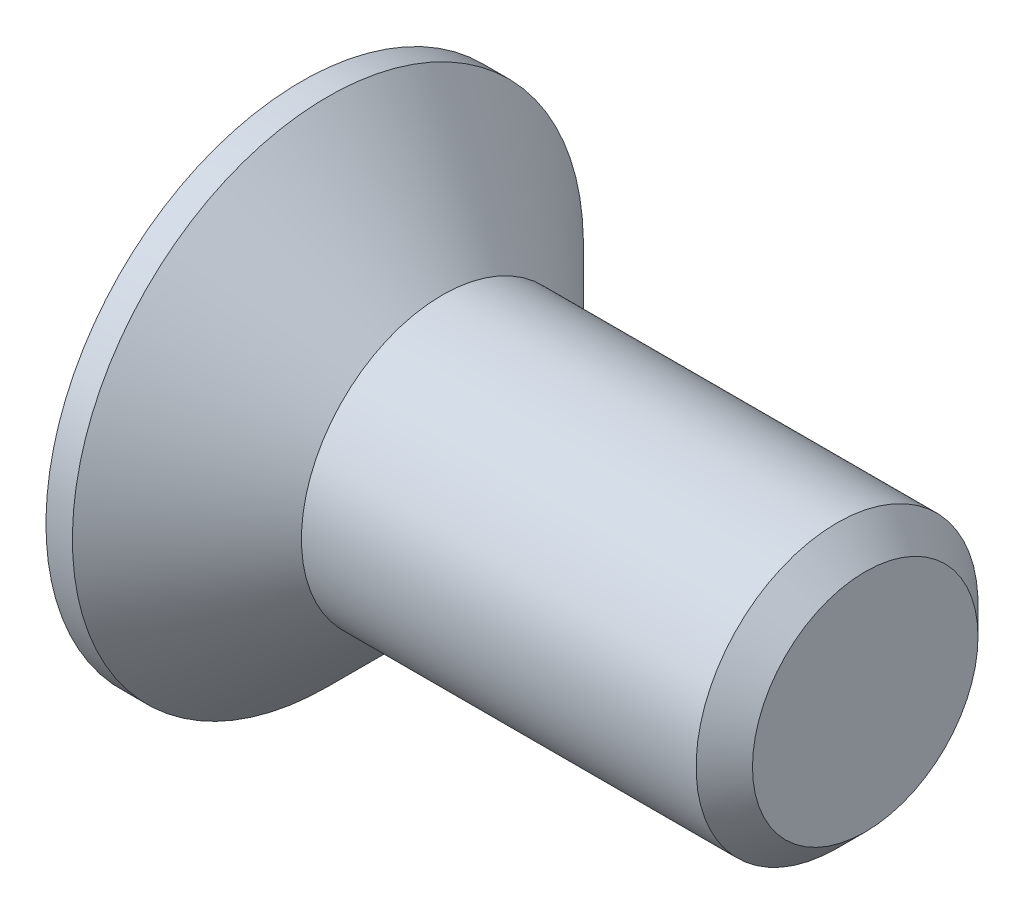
ISO-10303-21;
HEADER;
FILE_DESCRIPTION(('STEP AP214'),'2;1');
FILE_NAME('part.step','',(''),(''),'','','');
FILE_SCHEMA(('AUTOMOTIVE_DESIGN { 1 0 10303 214 1 1 1 1 }'));
ENDSEC;
DATA;
#1=APPLICATION_CONTEXT('core data for automotive mechanical design processes');
#2=APPLICATION_PROTOCOL_DEFINITION('international standard','automotive_design',2000,#1);
#3=PRODUCT_CONTEXT('',#1,'mechanical');
#4=PRODUCT('Part','Part','',(#3));
#5=PRODUCT_RELATED_PRODUCT_CATEGORY('part','',(#4));
#6=PRODUCT_DEFINITION_FORMATION('','',#4);
#7=PRODUCT_DEFINITION_CONTEXT('part definition',#1,'design');
#8=PRODUCT_DEFINITION('design','',#6,#7);
#9=PRODUCT_DEFINITION_SHAPE('','',#8);
#10=(LENGTH_UNIT() NAMED_UNIT(*) SI_UNIT(.MILLI.,.METRE.));
#11=(NAMED_UNIT(*) PLANE_ANGLE_UNIT() SI_UNIT($,.RADIAN.));
#12=(NAMED_UNIT(*) SI_UNIT($,.STERADIAN.) SOLID_ANGLE_UNIT());
#13=UNCERTAINTY_MEASURE_WITH_UNIT(LENGTH_MEASURE(1.E-05),#10,'distance_accuracy_value','');
#14=(GEOMETRIC_REPRESENTATION_CONTEXT(3) GLOBAL_UNCERTAINTY_ASSIGNED_CONTEXT((#13)) GLOBAL_UNIT_ASSIGNED_CONTEXT((#10,
#11,#12)) REPRESENTATION_CONTEXT('',''));
#15=CARTESIAN_POINT('',(0.,0.,0.));
#16=DIRECTION('',(0.,0.,1.));
#17=DIRECTION('',(1.,0.,0.));
#18=AXIS2_PLACEMENT_3D('',#15,#16,#17);
#19=CARTESIAN_POINT('',(0.,0.,0.));
#20=DIRECTION('',(-1.,0.,0.));
#21=DIRECTION('',(0.,-1.,0.));
#22=AXIS2_PLACEMENT_3D('',#19,#20,#21);
#23=CONICAL_SURFACE('',#22,4.,0.78539816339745);
#24=CARTESIAN_POINT('',(-3.24999999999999,0.,0.));
#25=DIRECTION('',(-1.,0.,0.));
#26=DIRECTION('',(0.,-1.,0.));
#27=AXIS2_PLACEMENT_3D('',#24,#25,#26);
#28=CIRCLE('',#27,7.25);
#29=CARTESIAN_POINT('',(-3.24999999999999,-7.25,0.));
#30=VERTEX_POINT('',#29);
#31=EDGE_CURVE('E189',#30,#30,#28,.T.);
#32=ORIENTED_EDGE('',*,*,#31,.F.);
#33=EDGE_LOOP('',(#32));
#34=FACE_BOUND('',#33,.T.);
#35=CARTESIAN_POINT('',(0.,0.,0.));
#36=DIRECTION('',(-1.,0.,0.));
#37=DIRECTION('',(0.,-1.,0.));
#38=AXIS2_PLACEMENT_3D('',#35,#36,#37);
#39=CIRCLE('',#38,4.);
#40=CARTESIAN_POINT('',(0.,-4.,0.));
#41=VERTEX_POINT('',#40);
#42=EDGE_CURVE('E212',#41,#41,#39,.T.);
#43=ORIENTED_EDGE('',*,*,#42,.T.);
#44=EDGE_LOOP('',(#43));
#45=FACE_BOUND('',#44,.T.);
#46=ADVANCED_FACE('F33',(#34,#45),#23,.T.);
#47=CARTESIAN_POINT('',(-4.,0.,0.));
#48=DIRECTION('',(-1.,0.,0.));
#49=DIRECTION('',(0.,-1.,0.));
#50=AXIS2_PLACEMENT_3D('',#47,#48,#49);
#51=CYLINDRICAL_SURFACE('',#50,4.);
#52=CARTESIAN_POINT('',(11.2,0.,0.));
#53=DIRECTION('',(-1.,0.,0.));
#54=DIRECTION('',(0.,-1.,0.));
#55=AXIS2_PLACEMENT_3D('',#52,#53,#54);
#56=CIRCLE('',#55,4.);
#57=CARTESIAN_POINT('',(11.2,-4.,0.));
#58=VERTEX_POINT('',#57);
#59=EDGE_CURVE('E41',#58,#58,#56,.T.);
#60=ORIENTED_EDGE('',*,*,#59,.T.);
#61=EDGE_LOOP('',(#60));
#62=FACE_BOUND('',#61,.T.);
#63=ORIENTED_EDGE('',*,*,#42,.F.);
#64=EDGE_LOOP('',(#63));
#65=FACE_BOUND('',#64,.T.);
#66=ADVANCED_FACE('F217',(#62,#65),#51,.T.);
#67=CARTESIAN_POINT('',(12.,0.,0.));
#68=DIRECTION('',(-1.,0.,0.));
#69=DIRECTION('',(0.,-1.,0.));
#70=AXIS2_PLACEMENT_3D('',#67,#68,#69);
#71=PLANE('',#70);
#72=CARTESIAN_POINT('',(12.,0.,0.));
#73=DIRECTION('',(-1.,0.,0.));
#74=DIRECTION('',(0.,-1.,0.));
#75=AXIS2_PLACEMENT_3D('',#72,#73,#74);
#76=CIRCLE('',#75,3.2);
#77=CARTESIAN_POINT('',(12.,-3.2,0.));
#78=VERTEX_POINT('',#77);
#79=EDGE_CURVE('E11',#78,#78,#76,.F.);
#80=ORIENTED_EDGE('',*,*,#79,.T.);
#81=EDGE_LOOP('',(#80));
#82=FACE_BOUND('',#81,.T.);
#83=ADVANCED_FACE('F239',(#82),#71,.F.);
#84=CARTESIAN_POINT('',(-4.,7.25,0.));
#85=DIRECTION('',(1.,0.,0.));
#86=DIRECTION('',(0.,1.,0.));
#87=AXIS2_PLACEMENT_3D('',#84,#85,#86);
#88=PLANE('',#87);
#89=DIRECTION('',(0.,0.,-1.));
#90=VECTOR('',#89,1.);
#91=CARTESIAN_POINT('',(-4.,1.09,-4.35));
#92=LINE('',#91,#90);
#93=CARTESIAN_POINT('',(-4.,1.09,-1.09));
#94=VERTEX_POINT('',#93);
#95=CARTESIAN_POINT('',(-4.,1.09,-4.35));
#96=VERTEX_POINT('',#95);
#97=EDGE_CURVE('E158',#94,#96,#92,.T.);
#98=ORIENTED_EDGE('',*,*,#97,.F.);
#99=DIRECTION('',(0.,-1.,0.));
#100=VECTOR('',#99,1.);
#101=CARTESIAN_POINT('',(-4.,1.09,-1.09));
#102=LINE('',#101,#100);
#103=CARTESIAN_POINT('',(-4.,4.35,-1.09));
#104=VERTEX_POINT('',#103);
#105=EDGE_CURVE('E48',#104,#94,#102,.T.);
#106=ORIENTED_EDGE('',*,*,#105,.F.);
#107=DIRECTION('',(0.,0.,-1.));
#108=VECTOR('',#107,1.);
#109=CARTESIAN_POINT('',(-4.,4.35,-1.09));
#110=LINE('',#109,#108);
#111=CARTESIAN_POINT('',(-4.,4.35,1.09));
#112=VERTEX_POINT('',#111);
#113=EDGE_CURVE('E185',#112,#104,#110,.T.);
#114=ORIENTED_EDGE('',*,*,#113,.F.);
#115=DIRECTION('',(0.,1.,0.));
#116=VECTOR('',#115,1.);
#117=CARTESIAN_POINT('',(-4.,4.35,1.09));
#118=LINE('',#117,#116);
#119=CARTESIAN_POINT('',(-4.,1.09,1.09));
#120=VERTEX_POINT('',#119);
#121=EDGE_CURVE('E183',#120,#112,#118,.T.);
#122=ORIENTED_EDGE('',*,*,#121,.F.);
#123=DIRECTION('',(0.,0.,-1.));
#124=VECTOR('',#123,1.);
#125=CARTESIAN_POINT('',(-4.,1.09,1.09));
#126=LINE('',#125,#124);
#127=CARTESIAN_POINT('',(-4.,1.09,4.35));
#128=VERTEX_POINT('',#127);
#129=EDGE_CURVE('E132',#128,#120,#126,.T.);
#130=ORIENTED_EDGE('',*,*,#129,.F.);
#131=DIRECTION('',(0.,1.,0.));
#132=VECTOR('',#131,1.);
#133=CARTESIAN_POINT('',(-4.,1.09,4.35));
#134=LINE('',#133,#132);
#135=CARTESIAN_POINT('',(-4.,-1.09,4.35));
#136=VERTEX_POINT('',#135);
#137=EDGE_CURVE('E179',#136,#128,#134,.T.);
#138=ORIENTED_EDGE('',*,*,#137,.F.);
#139=DIRECTION('',(0.,0.,1.));
#140=VECTOR('',#139,1.);
#141=CARTESIAN_POINT('',(-4.,-1.09,4.35));
#142=LINE('',#141,#140);
#143=CARTESIAN_POINT('',(-4.,-1.09,1.09));
#144=VERTEX_POINT('',#143);
#145=EDGE_CURVE('E176',#144,#136,#142,.T.);
#146=ORIENTED_EDGE('',*,*,#145,.F.);
#147=DIRECTION('',(0.,1.,0.));
#148=VECTOR('',#147,1.);
#149=CARTESIAN_POINT('',(-4.,-1.09,1.09));
#150=LINE('',#149,#148);
#151=CARTESIAN_POINT('',(-4.,-4.35,1.09));
#152=VERTEX_POINT('',#151);
#153=EDGE_CURVE('E173',#152,#144,#150,.T.);
#154=ORIENTED_EDGE('',*,*,#153,.F.);
#155=DIRECTION('',(0.,0.,1.));
#156=VECTOR('',#155,1.);
#157=CARTESIAN_POINT('',(-4.,-4.35,1.09));
#158=LINE('',#157,#156);
#159=CARTESIAN_POINT('',(-4.,-4.35,-1.09));
#160=VERTEX_POINT('',#159);
#161=EDGE_CURVE('E170',#160,#152,#158,.T.);
#162=ORIENTED_EDGE('',*,*,#161,.F.);
#163=DIRECTION('',(0.,-1.,0.));
#164=VECTOR('',#163,1.);
#165=CARTESIAN_POINT('',(-4.,-4.35,-1.09));
#166=LINE('',#165,#164);
#167=CARTESIAN_POINT('',(-4.,-1.09,-1.09));
#168=VERTEX_POINT('',#167);
#169=EDGE_CURVE('E167',#168,#160,#166,.T.);
#170=ORIENTED_EDGE('',*,*,#169,.F.);
#171=DIRECTION('',(0.,0.,1.));
#172=VECTOR('',#171,1.);
#173=CARTESIAN_POINT('',(-4.,-1.09,-1.09));
#174=LINE('',#173,#172);
#175=CARTESIAN_POINT('',(-4.,-1.09,-4.35));
#176=VERTEX_POINT('',#175);
#177=EDGE_CURVE('E164',#176,#168,#174,.T.);
#178=ORIENTED_EDGE('',*,*,#177,.F.);
#179=DIRECTION('',(0.,-1.,0.));
#180=VECTOR('',#179,1.);
#181=CARTESIAN_POINT('',(-4.,-1.09,-4.35));
#182=LINE('',#181,#180);
#183=EDGE_CURVE('E161',#96,#176,#182,.T.);
#184=ORIENTED_EDGE('',*,*,#183,.F.);
#185=EDGE_LOOP('',(#98,#106,#114,#122,#130,#138,#146,#154,#162,#170,#178,#184));
#186=FACE_BOUND('',#185,.T.);
#187=CARTESIAN_POINT('',(-4.,0.,0.));
#188=DIRECTION('',(-1.,0.,0.));
#189=DIRECTION('',(0.,-1.,0.));
#190=AXIS2_PLACEMENT_3D('',#187,#188,#189);
#191=CIRCLE('',#190,7.25);
#192=CARTESIAN_POINT('',(-4.,-7.25,0.));
#193=VERTEX_POINT('',#192);
#194=EDGE_CURVE('E209',#193,#193,#191,.T.);
#195=ORIENTED_EDGE('',*,*,#194,.T.);
#196=EDGE_LOOP('',(#195));
#197=FACE_BOUND('',#196,.T.);
#198=ADVANCED_FACE('F230',(#186,#197),#88,.F.);
#199=CARTESIAN_POINT('',(-4.,0.,0.));
#200=DIRECTION('',(-1.,0.,0.));
#201=DIRECTION('',(0.,-1.,0.));
#202=AXIS2_PLACEMENT_3D('',#199,#200,#201);
#203=CYLINDRICAL_SURFACE('',#202,7.25);
#204=ORIENTED_EDGE('',*,*,#194,.F.);
#205=EDGE_LOOP('',(#204));
#206=FACE_BOUND('',#205,.T.);
#207=ORIENTED_EDGE('',*,*,#31,.T.);
#208=EDGE_LOOP('',(#207));
#209=FACE_BOUND('',#208,.T.);
#210=ADVANCED_FACE('F222',(#206,#209),#203,.T.);
#211=CARTESIAN_POINT('',(11.2,0.,0.));
#212=DIRECTION('',(-1.,0.,0.));
#213=DIRECTION('',(0.,-1.,0.));
#214=AXIS2_PLACEMENT_3D('',#211,#212,#213);
#215=CONICAL_SURFACE('',#214,4.,0.785398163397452);
#216=ORIENTED_EDGE('',*,*,#79,.F.);
#217=EDGE_LOOP('',(#216));
#218=FACE_BOUND('',#217,.T.);
#219=ORIENTED_EDGE('',*,*,#59,.F.);
#220=EDGE_LOOP('',(#219));
#221=FACE_BOUND('',#220,.T.);
#222=ADVANCED_FACE('F35',(#218,#221),#215,.T.);
#223=CARTESIAN_POINT('',(-0.55,1.09,-1.09));
#224=DIRECTION('',(0.,0.,-1.));
#225=DIRECTION('',(-1.,0.,0.));
#226=AXIS2_PLACEMENT_3D('',#223,#224,#225);
#227=PLANE('',#226);
#228=ORIENTED_EDGE('',*,*,#105,.T.);
#229=DIRECTION('',(-1.,0.,0.));
#230=VECTOR('',#229,1.);
#231=CARTESIAN_POINT('',(-0.55,1.09,-1.09));
#232=LINE('',#231,#230);
#233=CARTESIAN_POINT('',(-0.55,1.09,-1.09));
#234=VERTEX_POINT('',#233);
#235=EDGE_CURVE('E96',#234,#94,#232,.T.);
#236=ORIENTED_EDGE('',*,*,#235,.F.);
#237=DIRECTION('',(0.,-1.,0.));
#238=VECTOR('',#237,1.);
#239=CARTESIAN_POINT('',(-0.55,1.09,-1.09));
#240=LINE('',#239,#238);
#241=CARTESIAN_POINT('',(-0.55,4.35,-1.09));
#242=VERTEX_POINT('',#241);
#243=EDGE_CURVE('E187',#242,#234,#240,.T.);
#244=ORIENTED_EDGE('',*,*,#243,.F.);
#245=DIRECTION('',(-1.,0.,0.));
#246=VECTOR('',#245,1.);
#247=CARTESIAN_POINT('',(-0.55,4.35,-1.09));
#248=LINE('',#247,#246);
#249=EDGE_CURVE('E56',#242,#104,#248,.T.);
#250=ORIENTED_EDGE('',*,*,#249,.T.);
#251=EDGE_LOOP('',(#228,#236,#244,#250));
#252=FACE_BOUND('',#251,.T.);
#253=ADVANCED_FACE('F221',(#252),#227,.F.);
#254=CARTESIAN_POINT('',(-0.55,4.35,-1.09));
#255=DIRECTION('',(0.,1.,0.));
#256=DIRECTION('',(-1.,0.,0.));
#257=AXIS2_PLACEMENT_3D('',#254,#255,#256);
#258=PLANE('',#257);
#259=ORIENTED_EDGE('',*,*,#113,.T.);
#260=ORIENTED_EDGE('',*,*,#249,.F.);
#261=DIRECTION('',(0.,0.,-1.));
#262=VECTOR('',#261,1.);
#263=CARTESIAN_POINT('',(-0.55,4.35,-1.09));
#264=LINE('',#263,#262);
#265=CARTESIAN_POINT('',(-0.55,4.35,1.09));
#266=VERTEX_POINT('',#265);
#267=EDGE_CURVE('E144',#266,#242,#264,.T.);
#268=ORIENTED_EDGE('',*,*,#267,.F.);
#269=DIRECTION('',(-1.,0.,0.));
#270=VECTOR('',#269,1.);
#271=CARTESIAN_POINT('',(-0.55,4.35,1.09));
#272=LINE('',#271,#270);
#273=EDGE_CURVE('E136',#266,#112,#272,.T.);
#274=ORIENTED_EDGE('',*,*,#273,.T.);
#275=EDGE_LOOP('',(#259,#260,#268,#274));
#276=FACE_BOUND('',#275,.T.);
#277=ADVANCED_FACE('F228',(#276),#258,.F.);
#278=CARTESIAN_POINT('',(-0.55,4.35,1.09));
#279=DIRECTION('',(0.,0.,1.));
#280=DIRECTION('',(1.,0.,0.));
#281=AXIS2_PLACEMENT_3D('',#278,#279,#280);
#282=PLANE('',#281);
#283=ORIENTED_EDGE('',*,*,#121,.T.);
#284=ORIENTED_EDGE('',*,*,#273,.F.);
#285=DIRECTION('',(0.,1.,0.));
#286=VECTOR('',#285,1.);
#287=CARTESIAN_POINT('',(-0.55,4.35,1.09));
#288=LINE('',#287,#286);
#289=CARTESIAN_POINT('',(-0.55,1.09,1.09));
#290=VERTEX_POINT('',#289);
#291=EDGE_CURVE('E140',#290,#266,#288,.T.);
#292=ORIENTED_EDGE('',*,*,#291,.F.);
#293=DIRECTION('',(-1.,0.,0.));
#294=VECTOR('',#293,1.);
#295=CARTESIAN_POINT('',(-0.55,1.09,1.09));
#296=LINE('',#295,#294);
#297=EDGE_CURVE('E125',#290,#120,#296,.T.);
#298=ORIENTED_EDGE('',*,*,#297,.T.);
#299=EDGE_LOOP('',(#283,#284,#292,#298));
#300=FACE_BOUND('',#299,.T.);
#301=ADVANCED_FACE('F141',(#300),#282,.F.);
#302=CARTESIAN_POINT('',(-0.55,1.09,1.09));
#303=DIRECTION('',(0.,1.,0.));
#304=DIRECTION('',(-1.,0.,0.));
#305=AXIS2_PLACEMENT_3D('',#302,#303,#304);
#306=PLANE('',#305);
#307=ORIENTED_EDGE('',*,*,#129,.T.);
#308=ORIENTED_EDGE('',*,*,#297,.F.);
#309=DIRECTION('',(0.,0.,-1.));
#310=VECTOR('',#309,1.);
#311=CARTESIAN_POINT('',(-0.55,1.09,1.09));
#312=LINE('',#311,#310);
#313=CARTESIAN_POINT('',(-0.55,1.09,4.35));
#314=VERTEX_POINT('',#313);
#315=EDGE_CURVE('E129',#314,#290,#312,.T.);
#316=ORIENTED_EDGE('',*,*,#315,.F.);
#317=DIRECTION('',(-1.,0.,0.));
#318=VECTOR('',#317,1.);
#319=CARTESIAN_POINT('',(-0.55,1.09,4.35));
#320=LINE('',#319,#318);
#321=EDGE_CURVE('E137',#314,#128,#320,.T.);
#322=ORIENTED_EDGE('',*,*,#321,.T.);
#323=EDGE_LOOP('',(#307,#308,#316,#322));
#324=FACE_BOUND('',#323,.T.);
#325=ADVANCED_FACE('F127',(#324),#306,.F.);
#326=CARTESIAN_POINT('',(-0.55,1.09,4.35));
#327=DIRECTION('',(0.,0.,1.));
#328=DIRECTION('',(1.,0.,0.));
#329=AXIS2_PLACEMENT_3D('',#326,#327,#328);
#330=PLANE('',#329);
#331=ORIENTED_EDGE('',*,*,#137,.T.);
#332=ORIENTED_EDGE('',*,*,#321,.F.);
#333=DIRECTION('',(0.,1.,0.));
#334=VECTOR('',#333,1.);
#335=CARTESIAN_POINT('',(-0.55,1.09,4.35));
#336=LINE('',#335,#334);
#337=CARTESIAN_POINT('',(-0.55,-1.09,4.35));
#338=VERTEX_POINT('',#337);
#339=EDGE_CURVE('E150',#338,#314,#336,.T.);
#340=ORIENTED_EDGE('',*,*,#339,.F.);
#341=DIRECTION('',(-1.,0.,0.));
#342=VECTOR('',#341,1.);
#343=CARTESIAN_POINT('',(-0.55,-1.09,4.35));
#344=LINE('',#343,#342);
#345=EDGE_CURVE('E192',#338,#136,#344,.T.);
#346=ORIENTED_EDGE('',*,*,#345,.T.);
#347=EDGE_LOOP('',(#331,#332,#340,#346));
#348=FACE_BOUND('',#347,.T.);
#349=ADVANCED_FACE('F277',(#348),#330,.F.);
#350=CARTESIAN_POINT('',(-0.55,-1.09,4.35));
#351=DIRECTION('',(0.,-1.,0.));
#352=DIRECTION('',(1.,0.,0.));
#353=AXIS2_PLACEMENT_3D('',#350,#351,#352);
#354=PLANE('',#353);
#355=ORIENTED_EDGE('',*,*,#145,.T.);
#356=ORIENTED_EDGE('',*,*,#345,.F.);
#357=DIRECTION('',(0.,0.,1.));
#358=VECTOR('',#357,1.);
#359=CARTESIAN_POINT('',(-0.55,-1.09,4.35));
#360=LINE('',#359,#358);
#361=CARTESIAN_POINT('',(-0.55,-1.09,1.09));
#362=VERTEX_POINT('',#361);
#363=EDGE_CURVE('E152',#362,#338,#360,.T.);
#364=ORIENTED_EDGE('',*,*,#363,.F.);
#365=DIRECTION('',(-1.,0.,0.));
#366=VECTOR('',#365,1.);
#367=CARTESIAN_POINT('',(-0.55,-1.09,1.09));
#368=LINE('',#367,#366);
#369=EDGE_CURVE('E194',#362,#144,#368,.T.);
#370=ORIENTED_EDGE('',*,*,#369,.T.);
#371=EDGE_LOOP('',(#355,#356,#364,#370));
#372=FACE_BOUND('',#371,.T.);
#373=ADVANCED_FACE('F273',(#372),#354,.F.);
#374=CARTESIAN_POINT('',(-0.55,-1.09,1.09));
#375=DIRECTION('',(0.,0.,1.));
#376=DIRECTION('',(1.,0.,0.));
#377=AXIS2_PLACEMENT_3D('',#374,#375,#376);
#378=PLANE('',#377);
#379=ORIENTED_EDGE('',*,*,#153,.T.);
#380=ORIENTED_EDGE('',*,*,#369,.F.);
#381=DIRECTION('',(0.,1.,0.));
#382=VECTOR('',#381,1.);
#383=CARTESIAN_POINT('',(-0.55,-1.09,1.09));
#384=LINE('',#383,#382);
#385=CARTESIAN_POINT('',(-0.55,-4.35,1.09));
#386=VERTEX_POINT('',#385);
#387=EDGE_CURVE('E422',#386,#362,#384,.T.);
#388=ORIENTED_EDGE('',*,*,#387,.F.);
#389=DIRECTION('',(-1.,0.,0.));
#390=VECTOR('',#389,1.);
#391=CARTESIAN_POINT('',(-0.55,-4.35,1.09));
#392=LINE('',#391,#390);
#393=EDGE_CURVE('E196',#386,#152,#392,.T.);
#394=ORIENTED_EDGE('',*,*,#393,.T.);
#395=EDGE_LOOP('',(#379,#380,#388,#394));
#396=FACE_BOUND('',#395,.T.);
#397=ADVANCED_FACE('F269',(#396),#378,.F.);
#398=CARTESIAN_POINT('',(-0.55,-4.35,1.09));
#399=DIRECTION('',(0.,-1.,0.));
#400=DIRECTION('',(1.,0.,0.));
#401=AXIS2_PLACEMENT_3D('',#398,#399,#400);
#402=PLANE('',#401);
#403=ORIENTED_EDGE('',*,*,#161,.T.);
#404=ORIENTED_EDGE('',*,*,#393,.F.);
#405=DIRECTION('',(0.,0.,1.));
#406=VECTOR('',#405,1.);
#407=CARTESIAN_POINT('',(-0.55,-4.35,1.09));
#408=LINE('',#407,#406);
#409=CARTESIAN_POINT('',(-0.55,-4.35,-1.09));
#410=VERTEX_POINT('',#409);
#411=EDGE_CURVE('E419',#410,#386,#408,.T.);
#412=ORIENTED_EDGE('',*,*,#411,.F.);
#413=DIRECTION('',(-1.,0.,0.));
#414=VECTOR('',#413,1.);
#415=CARTESIAN_POINT('',(-0.55,-4.35,-1.09));
#416=LINE('',#415,#414);
#417=EDGE_CURVE('E198',#410,#160,#416,.T.);
#418=ORIENTED_EDGE('',*,*,#417,.T.);
#419=EDGE_LOOP('',(#403,#404,#412,#418));
#420=FACE_BOUND('',#419,.T.);
#421=ADVANCED_FACE('F265',(#420),#402,.F.);
#422=CARTESIAN_POINT('',(-0.55,-4.35,-1.09));
#423=DIRECTION('',(0.,0.,-1.));
#424=DIRECTION('',(-1.,0.,0.));
#425=AXIS2_PLACEMENT_3D('',#422,#423,#424);
#426=PLANE('',#425);
#427=ORIENTED_EDGE('',*,*,#169,.T.);
#428=ORIENTED_EDGE('',*,*,#417,.F.);
#429=DIRECTION('',(0.,-1.,0.));
#430=VECTOR('',#429,1.);
#431=CARTESIAN_POINT('',(-0.55,-4.35,-1.09));
#432=LINE('',#431,#430);
#433=CARTESIAN_POINT('',(-0.55,-1.09,-1.09));
#434=VERTEX_POINT('',#433);
#435=EDGE_CURVE('E416',#434,#410,#432,.T.);
#436=ORIENTED_EDGE('',*,*,#435,.F.);
#437=DIRECTION('',(-1.,0.,0.));
#438=VECTOR('',#437,1.);
#439=CARTESIAN_POINT('',(-0.55,-1.09,-1.09));
#440=LINE('',#439,#438);
#441=EDGE_CURVE('E200',#434,#168,#440,.T.);
#442=ORIENTED_EDGE('',*,*,#441,.T.);
#443=EDGE_LOOP('',(#427,#428,#436,#442));
#444=FACE_BOUND('',#443,.T.);
#445=ADVANCED_FACE('F261',(#444),#426,.F.);
#446=CARTESIAN_POINT('',(-0.55,-1.09,-1.09));
#447=DIRECTION('',(0.,-1.,0.));
#448=DIRECTION('',(1.,0.,0.));
#449=AXIS2_PLACEMENT_3D('',#446,#447,#448);
#450=PLANE('',#449);
#451=ORIENTED_EDGE('',*,*,#177,.T.);
#452=ORIENTED_EDGE('',*,*,#441,.F.);
#453=DIRECTION('',(0.,0.,1.));
#454=VECTOR('',#453,1.);
#455=CARTESIAN_POINT('',(-0.55,-1.09,-1.09));
#456=LINE('',#455,#454);
#457=CARTESIAN_POINT('',(-0.55,-1.09,-4.35));
#458=VERTEX_POINT('',#457);
#459=EDGE_CURVE('E413',#458,#434,#456,.T.);
#460=ORIENTED_EDGE('',*,*,#459,.F.);
#461=DIRECTION('',(-1.,0.,0.));
#462=VECTOR('',#461,1.);
#463=CARTESIAN_POINT('',(-0.55,-1.09,-4.35));
#464=LINE('',#463,#462);
#465=EDGE_CURVE('E202',#458,#176,#464,.T.);
#466=ORIENTED_EDGE('',*,*,#465,.T.);
#467=EDGE_LOOP('',(#451,#452,#460,#466));
#468=FACE_BOUND('',#467,.T.);
#469=ADVANCED_FACE('F257',(#468),#450,.F.);
#470=CARTESIAN_POINT('',(-0.55,-1.09,-4.35));
#471=DIRECTION('',(0.,0.,-1.));
#472=DIRECTION('',(-1.,0.,0.));
#473=AXIS2_PLACEMENT_3D('',#470,#471,#472);
#474=PLANE('',#473);
#475=ORIENTED_EDGE('',*,*,#183,.T.);
#476=ORIENTED_EDGE('',*,*,#465,.F.);
#477=DIRECTION('',(0.,-1.,0.));
#478=VECTOR('',#477,1.);
#479=CARTESIAN_POINT('',(-0.55,-1.09,-4.35));
#480=LINE('',#479,#478);
#481=CARTESIAN_POINT('',(-0.55,1.09,-4.35));
#482=VERTEX_POINT('',#481);
#483=EDGE_CURVE('E408',#482,#458,#480,.T.);
#484=ORIENTED_EDGE('',*,*,#483,.F.);
#485=DIRECTION('',(-1.,0.,0.));
#486=VECTOR('',#485,1.);
#487=CARTESIAN_POINT('',(-0.55,1.09,-4.35));
#488=LINE('',#487,#486);
#489=EDGE_CURVE('E204',#482,#96,#488,.T.);
#490=ORIENTED_EDGE('',*,*,#489,.T.);
#491=EDGE_LOOP('',(#475,#476,#484,#490));
#492=FACE_BOUND('',#491,.T.);
#493=ADVANCED_FACE('F253',(#492),#474,.F.);
#494=CARTESIAN_POINT('',(-0.55,1.09,-4.35));
#495=DIRECTION('',(0.,1.,0.));
#496=DIRECTION('',(-1.,0.,0.));
#497=AXIS2_PLACEMENT_3D('',#494,#495,#496);
#498=PLANE('',#497);
#499=ORIENTED_EDGE('',*,*,#97,.T.);
#500=ORIENTED_EDGE('',*,*,#489,.F.);
#501=DIRECTION('',(0.,0.,-1.));
#502=VECTOR('',#501,1.);
#503=CARTESIAN_POINT('',(-0.55,1.09,-4.35));
#504=LINE('',#503,#502);
#505=EDGE_CURVE('E406',#234,#482,#504,.T.);
#506=ORIENTED_EDGE('',*,*,#505,.F.);
#507=ORIENTED_EDGE('',*,*,#235,.T.);
#508=EDGE_LOOP('',(#499,#500,#506,#507));
#509=FACE_BOUND('',#508,.T.);
#510=ADVANCED_FACE('F250',(#509),#498,.F.);
#511=CARTESIAN_POINT('',(-0.55,0.,0.));
#512=DIRECTION('',(1.,0.,0.));
#513=DIRECTION('',(0.,0.,-1.));
#514=AXIS2_PLACEMENT_3D('',#511,#512,#513);
#515=PLANE('',#514);
#516=ORIENTED_EDGE('',*,*,#243,.T.);
#517=ORIENTED_EDGE('',*,*,#505,.T.);
#518=ORIENTED_EDGE('',*,*,#483,.T.);
#519=ORIENTED_EDGE('',*,*,#459,.T.);
#520=ORIENTED_EDGE('',*,*,#435,.T.);
#521=ORIENTED_EDGE('',*,*,#411,.T.);
#522=ORIENTED_EDGE('',*,*,#387,.T.);
#523=ORIENTED_EDGE('',*,*,#363,.T.);
#524=ORIENTED_EDGE('',*,*,#339,.T.);
#525=ORIENTED_EDGE('',*,*,#315,.T.);
#526=ORIENTED_EDGE('',*,*,#291,.T.);
#527=ORIENTED_EDGE('',*,*,#267,.T.);
#528=EDGE_LOOP('',(#516,#517,#518,#519,#520,#521,#522,#523,#524,#525,#526,#527));
#529=FACE_BOUND('',#528,.T.);
#530=ADVANCED_FACE('F147',(#529),#515,.F.);
#531=CLOSED_SHELL('',(#46,#66,#83,#198,#210,#222,#253,#277,#301,#325,#349,#373,#397,#421,#445,
#469,#493,#510,#530));
#532=MANIFOLD_SOLID_BREP('B2',#531);
#533=ADVANCED_BREP_SHAPE_REPRESENTATION('',(#18,#532),#14);
#534=SHAPE_DEFINITION_REPRESENTATION(#9,#533);
ENDSEC;
END-ISO-10303-21;
